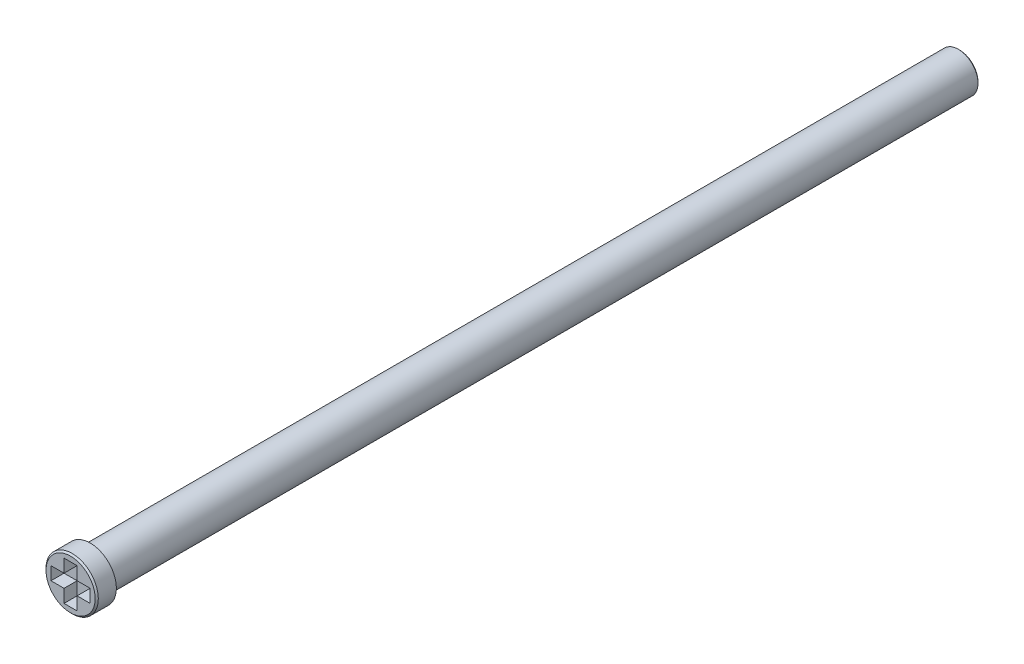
from build123d import *

# Parameters (mm, degrees)
SKETCH_1_R          = 2
EXTRUDE_1_DEPTH     = 68
SKETCH_2_OUTSIDE_W  = 19.646
SKETCH_2_OUTSIDE_H  = 19.646
SKETCH_2_OUTSIDE_R  = 1.5
CUT_EXTRUDE_1_DEPTH = 66.5
CHAMFER_1_SIZE      = 0.1
CHAMFER_2_SIZE      = 0.12
CUT_EXTRUDE_2_DEPTH = 1


with BuildPart() as part:
    # Sketch 1 → Extrude 1 (new body)
    with BuildSketch(Plane.XY):
        Circle(SKETCH_1_R)
    extrude(amount=EXTRUDE_1_DEPTH)

    # Sketch 2 outside → Cut-Extrude 1 (cut)
    with BuildSketch(Plane(origin=(0, 0, 0), x_dir=(-1, 0, 0), z_dir=(0, 0, -1))):
        Rectangle(SKETCH_2_OUTSIDE_W, SKETCH_2_OUTSIDE_H)
        Circle(SKETCH_2_OUTSIDE_R, mode=Mode.SUBTRACT)
    extrude(amount=-CUT_EXTRUDE_1_DEPTH, mode=Mode.SUBTRACT)

    # Chamfer 1
    chamfer_1_edges = [part.edges().sort_by_distance(p)[0] for p in [
        (1.5, 0, 0),
    ]]
    chamfer(chamfer_1_edges, length=CHAMFER_1_SIZE)

    # Chamfer 2
    chamfer_2_edges = [part.edges().sort_by_distance(p)[0] for p in [
        (-2, 0, 68),
    ]]
    chamfer(chamfer_2_edges, length=CHAMFER_2_SIZE)

    # Sketch 3 → Cut-Extrude 2 (cut)
    with BuildSketch(Plane.XY.offset(68)):
        Polygon((-0.5, 0.5), (-1.5, 0.5), (-1.5, -0.5), (-0.5, -0.5), (-0.5, -1.5), (0.5, -1.5), (0.5, -0.5), (1.5, -0.5), (1.5, 0.5), (0.5, 0.5), (0.5, 1.5), (-0.5, 1.5), align=None)
    extrude(amount=-CUT_EXTRUDE_2_DEPTH, mode=Mode.SUBTRACT)


solid = part.part
